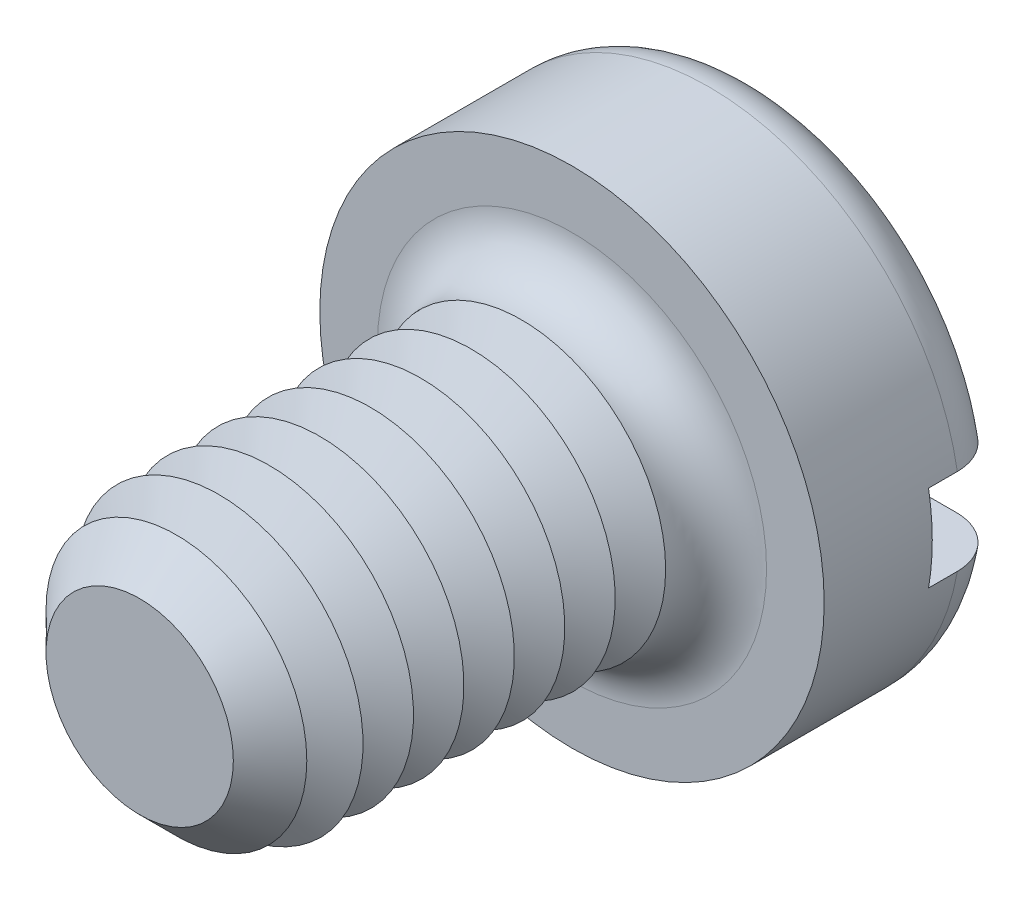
from build123d import *

# Parameters (mm, degrees)
SKETCH3_R           = 3.5
BOSS_EXTRUDE2_DEPTH = 2.6
SKETCH4_R           = 2
BOSS_EXTRUDE3_DEPTH = 6
FILLET1_R           = 0.7
CHAMFER1_SIZE       = 0.7
LPATTERN1_COUNT     = 8
LPATTERN1_PITCH     = 0.7
SKETCH8_W           = 7
SKETCH8_H           = 1.2
CUT_EXTRUDE1_DEPTH  = 1.1


with BuildPart() as part:
    # Sketch3 → Boss-Extrude2 (new body)
    with BuildSketch(Plane.XY):
        Circle(SKETCH3_R)
    extrude(amount=-BOSS_EXTRUDE2_DEPTH)

    # Sketch4 → Boss-Extrude3 (add)
    with BuildSketch(Plane.XY):
        Circle(SKETCH4_R)
    extrude(amount=BOSS_EXTRUDE3_DEPTH)

    # Fillet1
    fillet1_edges = [part.edges().sort_by_distance(p)[0] for p in [
        (-3.5, 0, -2.6),
        (-2, 0, 0),
    ]]
    fillet(fillet1_edges, radius=FILLET1_R)

    # Chamfer1
    chamfer1_edges = [part.edges().sort_by_distance(p)[0] for p in [
        (-2, 0, 6),
    ]]
    chamfer(chamfer1_edges, length=CHAMFER1_SIZE)

    # Sketch6 → Cut-Revolve1 (revolve, cut)
    with BuildSketch(Plane(origin=(0, 0, 0), x_dir=(0, 0, -1), z_dir=(1, 0, 0)), mode=Mode.PRIVATE) as cut_revolve1_sk:
        Polygon((-0.7, 2), (-1.05, 1.393782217), (-1.4, 2), align=None)
    cut_revolve1 = revolve(cut_revolve1_sk.sketch.rotate(Axis((0, 0, -1.694361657), (0, 0, 1)), 90), axis=Axis((0, 0, -1.694361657), (0, 0, 1)), mode=Mode.SUBTRACT)

    # LPattern1: Cut-Revolve1 ×8
    with Locations(*[(0, 0, i * LPATTERN1_PITCH) for i in range(1, LPATTERN1_COUNT)]):
        add(cut_revolve1, mode=Mode.SUBTRACT)

    # Sketch8 → Cut-Extrude1 (cut)
    with BuildSketch(Plane(origin=(0, 0, -2.6), x_dir=(-1, 0, 0), z_dir=(0, 0, -1))):
        Rectangle(SKETCH8_W, SKETCH8_H)
    extrude(amount=-CUT_EXTRUDE1_DEPTH, mode=Mode.SUBTRACT)


solid = part.part
